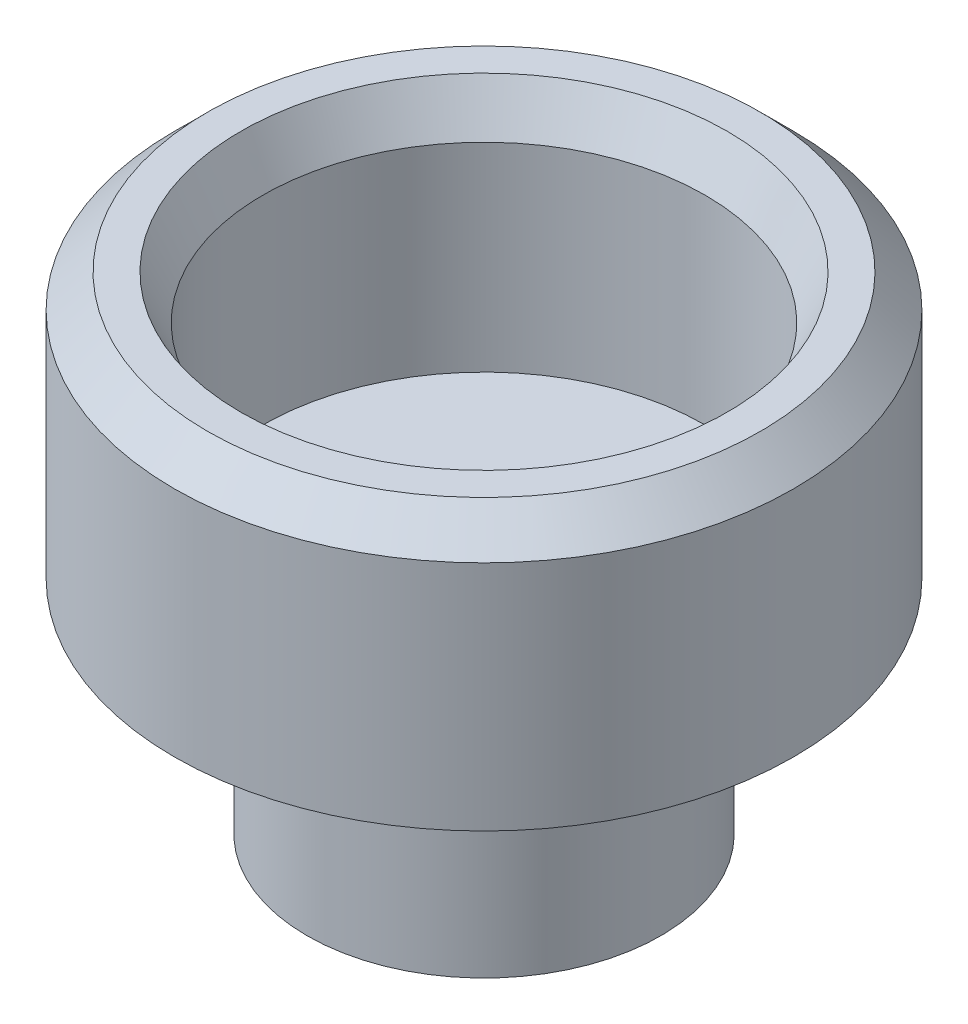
ISO-10303-21;
HEADER;
FILE_DESCRIPTION(('STEP AP214'),'2;1');
FILE_NAME('part.step','',(''),(''),'','','');
FILE_SCHEMA(('AUTOMOTIVE_DESIGN { 1 0 10303 214 1 1 1 1 }'));
ENDSEC;
DATA;
#1=APPLICATION_CONTEXT('core data for automotive mechanical design processes');
#2=APPLICATION_PROTOCOL_DEFINITION('international standard','automotive_design',2000,#1);
#3=PRODUCT_CONTEXT('',#1,'mechanical');
#4=PRODUCT('Part','Part','',(#3));
#5=PRODUCT_RELATED_PRODUCT_CATEGORY('part','',(#4));
#6=PRODUCT_DEFINITION_FORMATION('','',#4);
#7=PRODUCT_DEFINITION_CONTEXT('part definition',#1,'design');
#8=PRODUCT_DEFINITION('design','',#6,#7);
#9=PRODUCT_DEFINITION_SHAPE('','',#8);
#10=(LENGTH_UNIT() NAMED_UNIT(*) SI_UNIT(.MILLI.,.METRE.));
#11=(NAMED_UNIT(*) PLANE_ANGLE_UNIT() SI_UNIT($,.RADIAN.));
#12=(NAMED_UNIT(*) SI_UNIT($,.STERADIAN.) SOLID_ANGLE_UNIT());
#13=UNCERTAINTY_MEASURE_WITH_UNIT(LENGTH_MEASURE(1.E-05),#10,'distance_accuracy_value','');
#14=(GEOMETRIC_REPRESENTATION_CONTEXT(3) GLOBAL_UNCERTAINTY_ASSIGNED_CONTEXT((#13)) GLOBAL_UNIT_ASSIGNED_CONTEXT((#10,
#11,#12)) REPRESENTATION_CONTEXT('',''));
#15=CARTESIAN_POINT('',(0.,0.,0.));
#16=DIRECTION('',(0.,0.,1.));
#17=DIRECTION('',(1.,0.,0.));
#18=AXIS2_PLACEMENT_3D('',#15,#16,#17);
#19=CARTESIAN_POINT('',(0.,10.,0.));
#20=DIRECTION('',(0.,-1.,0.));
#21=DIRECTION('',(0.,0.,-1.));
#22=AXIS2_PLACEMENT_3D('',#19,#20,#21);
#23=CYLINDRICAL_SURFACE('',#22,8.);
#24=CARTESIAN_POINT('',(0.,6.00000000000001,0.));
#25=DIRECTION('',(0.,1.,0.));
#26=DIRECTION('',(0.,0.,1.));
#27=AXIS2_PLACEMENT_3D('',#24,#25,#26);
#28=CIRCLE('',#27,8.);
#29=CARTESIAN_POINT('',(0.,6.00000000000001,8.));
#30=VERTEX_POINT('',#29);
#31=EDGE_CURVE('E53',#30,#30,#28,.F.);
#32=ORIENTED_EDGE('',*,*,#31,.T.);
#33=EDGE_LOOP('',(#32));
#34=FACE_BOUND('',#33,.T.);
#35=CARTESIAN_POINT('',(0.,0.,0.));
#36=DIRECTION('',(0.,1.,0.));
#37=DIRECTION('',(0.,0.,1.));
#38=AXIS2_PLACEMENT_3D('',#35,#36,#37);
#39=CIRCLE('',#38,8.);
#40=CARTESIAN_POINT('',(0.,0.,8.));
#41=VERTEX_POINT('',#40);
#42=EDGE_CURVE('E56',#41,#41,#39,.T.);
#43=ORIENTED_EDGE('',*,*,#42,.T.);
#44=EDGE_LOOP('',(#43));
#45=FACE_BOUND('',#44,.T.);
#46=ADVANCED_FACE('F33',(#34,#45),#23,.T.);
#47=CARTESIAN_POINT('',(0.,0.,0.));
#48=DIRECTION('',(0.,1.,0.));
#49=DIRECTION('',(0.,0.,1.));
#50=AXIS2_PLACEMENT_3D('',#47,#48,#49);
#51=PLANE('',#50);
#52=CARTESIAN_POINT('',(0.,0.,0.));
#53=DIRECTION('',(0.,-1.,0.));
#54=DIRECTION('',(0.,0.,-1.));
#55=AXIS2_PLACEMENT_3D('',#52,#53,#54);
#56=CIRCLE('',#55,3.5);
#57=CARTESIAN_POINT('',(0.,0.,-3.5));
#58=VERTEX_POINT('',#57);
#59=EDGE_CURVE('E62',#58,#58,#56,.T.);
#60=ORIENTED_EDGE('',*,*,#59,.F.);
#61=EDGE_LOOP('',(#60));
#62=FACE_BOUND('',#61,.T.);
#63=ORIENTED_EDGE('',*,*,#42,.F.);
#64=EDGE_LOOP('',(#63));
#65=FACE_BOUND('',#64,.T.);
#66=ADVANCED_FACE('F87',(#62,#65),#51,.F.);
#67=CARTESIAN_POINT('',(0.,22.,0.));
#68=DIRECTION('',(0.,-1.,0.));
#69=DIRECTION('',(0.,0.,-1.));
#70=AXIS2_PLACEMENT_3D('',#67,#68,#69);
#71=CYLINDRICAL_SURFACE('',#70,14.);
#72=CARTESIAN_POINT('',(0.,20.5,0.));
#73=DIRECTION('',(0.,1.,0.));
#74=DIRECTION('',(0.,0.,1.));
#75=AXIS2_PLACEMENT_3D('',#72,#73,#74);
#76=CIRCLE('',#75,14.);
#77=CARTESIAN_POINT('',(0.,20.5,14.));
#78=VERTEX_POINT('',#77);
#79=EDGE_CURVE('E44',#78,#78,#76,.F.);
#80=ORIENTED_EDGE('',*,*,#79,.T.);
#81=EDGE_LOOP('',(#80));
#82=FACE_BOUND('',#81,.T.);
#83=CARTESIAN_POINT('',(0.,10.,0.));
#84=DIRECTION('',(0.,1.,0.));
#85=DIRECTION('',(0.,0.,1.));
#86=AXIS2_PLACEMENT_3D('',#83,#84,#85);
#87=CIRCLE('',#86,14.);
#88=CARTESIAN_POINT('',(0.,10.,14.));
#89=VERTEX_POINT('',#88);
#90=EDGE_CURVE('E59',#89,#89,#87,.T.);
#91=ORIENTED_EDGE('',*,*,#90,.T.);
#92=EDGE_LOOP('',(#91));
#93=FACE_BOUND('',#92,.T.);
#94=ADVANCED_FACE('F93',(#82,#93),#71,.T.);
#95=CARTESIAN_POINT('',(0.,22.,0.));
#96=DIRECTION('',(0.,1.,0.));
#97=DIRECTION('',(0.,0.,1.));
#98=AXIS2_PLACEMENT_3D('',#95,#96,#97);
#99=PLANE('',#98);
#100=CARTESIAN_POINT('',(0.,22.,0.));
#101=DIRECTION('',(0.,1.,0.));
#102=DIRECTION('',(0.,0.,1.));
#103=AXIS2_PLACEMENT_3D('',#100,#101,#102);
#104=CIRCLE('',#103,11.);
#105=CARTESIAN_POINT('',(0.,22.,11.));
#106=VERTEX_POINT('',#105);
#107=EDGE_CURVE('E10',#106,#106,#104,.F.);
#108=ORIENTED_EDGE('',*,*,#107,.T.);
#109=EDGE_LOOP('',(#108));
#110=FACE_BOUND('',#109,.T.);
#111=CARTESIAN_POINT('',(0.,22.,0.));
#112=DIRECTION('',(0.,1.,0.));
#113=DIRECTION('',(0.,0.,1.));
#114=AXIS2_PLACEMENT_3D('',#111,#112,#113);
#115=CIRCLE('',#114,12.5);
#116=CARTESIAN_POINT('',(0.,22.,12.5));
#117=VERTEX_POINT('',#116);
#118=EDGE_CURVE('E48',#117,#117,#115,.T.);
#119=ORIENTED_EDGE('',*,*,#118,.T.);
#120=EDGE_LOOP('',(#119));
#121=FACE_BOUND('',#120,.T.);
#122=ADVANCED_FACE('F102',(#110,#121),#99,.T.);
#123=CARTESIAN_POINT('',(0.,10.,0.));
#124=DIRECTION('',(0.,1.,0.));
#125=DIRECTION('',(0.,0.,1.));
#126=AXIS2_PLACEMENT_3D('',#123,#124,#125);
#127=CONICAL_SURFACE('',#126,14.,0.982793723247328);
#128=ORIENTED_EDGE('',*,*,#31,.F.);
#129=EDGE_LOOP('',(#128));
#130=FACE_BOUND('',#129,.T.);
#131=ORIENTED_EDGE('',*,*,#90,.F.);
#132=EDGE_LOOP('',(#131));
#133=FACE_BOUND('',#132,.T.);
#134=ADVANCED_FACE('F99',(#130,#133),#127,.T.);
#135=CARTESIAN_POINT('',(0.,22.,0.));
#136=DIRECTION('',(0.,-1.,0.));
#137=DIRECTION('',(0.,0.,-1.));
#138=AXIS2_PLACEMENT_3D('',#135,#136,#137);
#139=CONICAL_SURFACE('',#138,12.5,0.785398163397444);
#140=ORIENTED_EDGE('',*,*,#79,.F.);
#141=EDGE_LOOP('',(#140));
#142=FACE_BOUND('',#141,.T.);
#143=ORIENTED_EDGE('',*,*,#118,.F.);
#144=EDGE_LOOP('',(#143));
#145=FACE_BOUND('',#144,.T.);
#146=ADVANCED_FACE('F101',(#142,#145),#139,.T.);
#147=CARTESIAN_POINT('',(0.,11.,0.));
#148=DIRECTION('',(0.,-1.,0.));
#149=DIRECTION('',(0.,0.,-1.));
#150=AXIS2_PLACEMENT_3D('',#147,#148,#149);
#151=CYLINDRICAL_SURFACE('',#150,3.5);
#152=CARTESIAN_POINT('',(0.,11.,0.));
#153=DIRECTION('',(0.,1.,0.));
#154=DIRECTION('',(0.,0.,1.));
#155=AXIS2_PLACEMENT_3D('',#152,#153,#154);
#156=CIRCLE('',#155,3.5);
#157=CARTESIAN_POINT('',(0.,11.,3.5));
#158=VERTEX_POINT('',#157);
#159=EDGE_CURVE('E65',#158,#158,#156,.F.);
#160=ORIENTED_EDGE('',*,*,#159,.F.);
#161=EDGE_LOOP('',(#160));
#162=FACE_BOUND('',#161,.T.);
#163=ORIENTED_EDGE('',*,*,#59,.T.);
#164=EDGE_LOOP('',(#163));
#165=FACE_BOUND('',#164,.T.);
#166=ADVANCED_FACE('F83',(#162,#165),#151,.F.);
#167=CARTESIAN_POINT('',(0.,11.,0.));
#168=DIRECTION('',(0.,1.,0.));
#169=DIRECTION('',(0.,0.,1.));
#170=AXIS2_PLACEMENT_3D('',#167,#168,#169);
#171=PLANE('',#170);
#172=CARTESIAN_POINT('',(0.,11.,0.));
#173=DIRECTION('',(0.,1.,0.));
#174=DIRECTION('',(0.,0.,1.));
#175=AXIS2_PLACEMENT_3D('',#172,#173,#174);
#176=CIRCLE('',#175,10.);
#177=CARTESIAN_POINT('',(0.,11.,10.));
#178=VERTEX_POINT('',#177);
#179=EDGE_CURVE('E68',#178,#178,#176,.T.);
#180=ORIENTED_EDGE('',*,*,#179,.T.);
#181=EDGE_LOOP('',(#180));
#182=FACE_BOUND('',#181,.T.);
#183=ORIENTED_EDGE('',*,*,#159,.T.);
#184=EDGE_LOOP('',(#183));
#185=FACE_BOUND('',#184,.T.);
#186=ADVANCED_FACE('F72',(#182,#185),#171,.T.);
#187=CARTESIAN_POINT('',(0.,11.,0.));
#188=DIRECTION('',(0.,1.,0.));
#189=DIRECTION('',(0.,0.,1.));
#190=AXIS2_PLACEMENT_3D('',#187,#188,#189);
#191=CYLINDRICAL_SURFACE('',#190,10.);
#192=CARTESIAN_POINT('',(0.,20.,0.));
#193=DIRECTION('',(0.,1.,0.));
#194=DIRECTION('',(0.,0.,1.));
#195=AXIS2_PLACEMENT_3D('',#192,#193,#194);
#196=CIRCLE('',#195,10.);
#197=CARTESIAN_POINT('',(0.,20.,10.));
#198=VERTEX_POINT('',#197);
#199=EDGE_CURVE('E40',#198,#198,#196,.T.);
#200=ORIENTED_EDGE('',*,*,#199,.T.);
#201=EDGE_LOOP('',(#200));
#202=FACE_BOUND('',#201,.T.);
#203=ORIENTED_EDGE('',*,*,#179,.F.);
#204=EDGE_LOOP('',(#203));
#205=FACE_BOUND('',#204,.T.);
#206=ADVANCED_FACE('F75',(#202,#205),#191,.F.);
#207=CARTESIAN_POINT('',(0.,20.,0.));
#208=DIRECTION('',(0.,1.,0.));
#209=DIRECTION('',(0.,0.,1.));
#210=AXIS2_PLACEMENT_3D('',#207,#208,#209);
#211=CONICAL_SURFACE('',#210,10.,0.463647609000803);
#212=ORIENTED_EDGE('',*,*,#107,.F.);
#213=EDGE_LOOP('',(#212));
#214=FACE_BOUND('',#213,.T.);
#215=ORIENTED_EDGE('',*,*,#199,.F.);
#216=EDGE_LOOP('',(#215));
#217=FACE_BOUND('',#216,.T.);
#218=ADVANCED_FACE('F35',(#214,#217),#211,.F.);
#219=CLOSED_SHELL('',(#46,#66,#94,#122,#134,#146,#166,#186,#206,#218));
#220=MANIFOLD_SOLID_BREP('B2',#219);
#221=ADVANCED_BREP_SHAPE_REPRESENTATION('',(#18,#220),#14);
#222=SHAPE_DEFINITION_REPRESENTATION(#9,#221);
ENDSEC;
END-ISO-10303-21;
